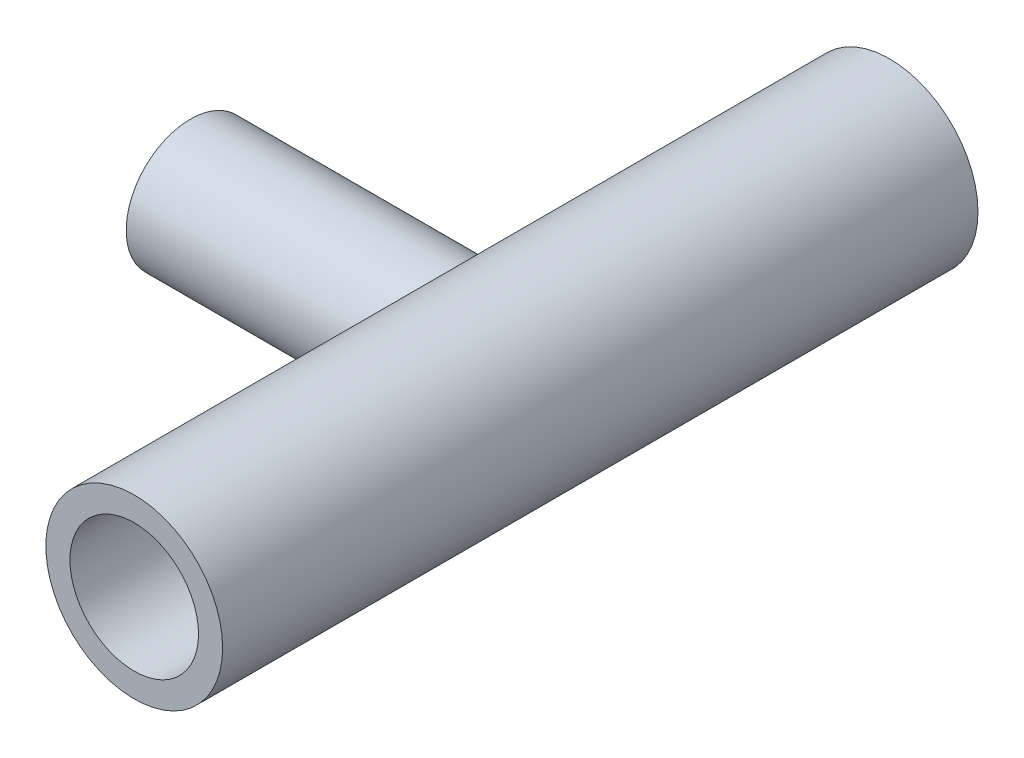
ISO-10303-21;
HEADER;
FILE_DESCRIPTION(('STEP AP214'),'2;1');
FILE_NAME('part.step','',(''),(''),'','','');
FILE_SCHEMA(('AUTOMOTIVE_DESIGN { 1 0 10303 214 1 1 1 1 }'));
ENDSEC;
DATA;
#1=APPLICATION_CONTEXT('core data for automotive mechanical design processes');
#2=APPLICATION_PROTOCOL_DEFINITION('international standard','automotive_design',2000,#1);
#3=PRODUCT_CONTEXT('',#1,'mechanical');
#4=PRODUCT('Part','Part','',(#3));
#5=PRODUCT_RELATED_PRODUCT_CATEGORY('part','',(#4));
#6=PRODUCT_DEFINITION_FORMATION('','',#4);
#7=PRODUCT_DEFINITION_CONTEXT('part definition',#1,'design');
#8=PRODUCT_DEFINITION('design','',#6,#7);
#9=PRODUCT_DEFINITION_SHAPE('','',#8);
#10=(LENGTH_UNIT() NAMED_UNIT(*) SI_UNIT(.MILLI.,.METRE.));
#11=(NAMED_UNIT(*) PLANE_ANGLE_UNIT() SI_UNIT($,.RADIAN.));
#12=(NAMED_UNIT(*) SI_UNIT($,.STERADIAN.) SOLID_ANGLE_UNIT());
#13=UNCERTAINTY_MEASURE_WITH_UNIT(LENGTH_MEASURE(1.E-05),#10,'distance_accuracy_value','');
#14=(GEOMETRIC_REPRESENTATION_CONTEXT(3) GLOBAL_UNCERTAINTY_ASSIGNED_CONTEXT((#13)) GLOBAL_UNIT_ASSIGNED_CONTEXT((#10,
#11,#12)) REPRESENTATION_CONTEXT('',''));
#15=CARTESIAN_POINT('',(0.,0.,0.));
#16=DIRECTION('',(0.,0.,1.));
#17=DIRECTION('',(1.,0.,0.));
#18=AXIS2_PLACEMENT_3D('',#15,#16,#17);
#19=CARTESIAN_POINT('',(0.,0.,0.));
#20=DIRECTION('',(1.,0.,0.));
#21=DIRECTION('',(0.,0.,-1.));
#22=AXIS2_PLACEMENT_3D('',#19,#20,#21);
#23=CYLINDRICAL_SURFACE('',#22,20.32);
#24=CARTESIAN_POINT('',(73.66,0.,-20.32));
#25=CARTESIAN_POINT('',(73.6600047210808,0.499914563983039,-20.319995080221));
#26=CARTESIAN_POINT('',(73.6734506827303,0.999977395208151,-20.3015175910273));
#27=CARTESIAN_POINT('',(73.7269310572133,1.99618720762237,-20.2278865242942));
#28=CARTESIAN_POINT('',(73.766982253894,2.49233151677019,-20.1727097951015));
#29=CARTESIAN_POINT('',(73.8728399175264,3.47768027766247,-20.0264016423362));
#30=CARTESIAN_POINT('',(73.9387055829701,3.96686608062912,-19.9351875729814));
#31=CARTESIAN_POINT('',(74.094650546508,4.93345998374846,-19.718233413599));
#32=CARTESIAN_POINT('',(74.1847263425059,5.41086977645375,-19.5924983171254));
#33=CARTESIAN_POINT('',(74.3865226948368,6.34812576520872,-19.3091164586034));
#34=CARTESIAN_POINT('',(74.4981103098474,6.80806006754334,-19.1516654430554));
#35=CARTESIAN_POINT('',(74.7410408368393,7.71093407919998,-18.8063167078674));
#36=CARTESIAN_POINT('',(74.8723844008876,8.15387322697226,-18.6184179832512));
#37=CARTESIAN_POINT('',(75.1523210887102,9.02059776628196,-18.2142732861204));
#38=CARTESIAN_POINT('',(75.3009047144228,9.44439352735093,-17.9980429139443));
#39=CARTESIAN_POINT('',(75.6128653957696,10.2717055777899,-17.5390508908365));
#40=CARTESIAN_POINT('',(75.7762443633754,10.675219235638,-17.2962858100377));
#41=CARTESIAN_POINT('',(76.1306034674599,11.4965747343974,-16.7628240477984));
#42=CARTESIAN_POINT('',(76.3227427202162,11.9123887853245,-16.4697765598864));
#43=CARTESIAN_POINT('',(76.7181410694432,12.7176226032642,-15.8562522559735));
#44=CARTESIAN_POINT('',(76.9214007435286,13.1070409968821,-15.5357740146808));
#45=CARTESIAN_POINT('',(77.3358866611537,13.8593322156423,-14.8685729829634));
#46=CARTESIAN_POINT('',(77.5471241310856,14.222165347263,-14.521812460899));
#47=CARTESIAN_POINT('',(77.9737020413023,14.9200854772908,-13.8037734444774));
#48=CARTESIAN_POINT('',(78.1890427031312,15.2551709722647,-13.4324936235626));
#49=CARTESIAN_POINT('',(78.6612610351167,15.958375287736,-12.5931333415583));
#50=CARTESIAN_POINT('',(78.9182135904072,16.3205725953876,-12.1201117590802));
#51=CARTESIAN_POINT('',(79.4256484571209,17.0036121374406,-11.1416231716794));
#52=CARTESIAN_POINT('',(79.6761289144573,17.3244426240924,-10.6361470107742));
#53=CARTESIAN_POINT('',(80.1623367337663,17.9225677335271,-9.59397562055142));
#54=CARTESIAN_POINT('',(80.3980808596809,18.1999123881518,-9.05731725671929));
#55=CARTESIAN_POINT('',(80.7336963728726,18.5814355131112,-8.22951338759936));
#56=CARTESIAN_POINT('',(80.8425495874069,18.70284160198,-7.94983000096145));
#57=CARTESIAN_POINT('',(81.0530214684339,18.9338233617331,-7.38284916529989));
#58=CARTESIAN_POINT('',(81.1546384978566,19.043396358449,-7.0955500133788));
#59=CARTESIAN_POINT('',(81.3823743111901,19.2854206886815,-6.41453609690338));
#60=CARTESIAN_POINT('',(81.5050540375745,19.4129577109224,-6.01789715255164));
#61=CARTESIAN_POINT('',(81.7313537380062,19.6445088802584,-5.2125927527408));
#62=CARTESIAN_POINT('',(81.8349796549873,19.7485303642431,-4.80393109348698));
#63=CARTESIAN_POINT('',(82.0195565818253,19.9315513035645,-3.9767704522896));
#64=CARTESIAN_POINT('',(82.1005489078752,20.0105963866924,-3.55829092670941));
#65=CARTESIAN_POINT('',(82.2369405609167,20.1426061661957,-2.7130665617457));
#66=CARTESIAN_POINT('',(82.292339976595,20.1955709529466,-2.28632175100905));
#67=CARTESIAN_POINT('',(82.3754118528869,20.2746681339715,-1.42438679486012));
#68=CARTESIAN_POINT('',(82.4028743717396,20.3005973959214,-0.989157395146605));
#69=CARTESIAN_POINT('',(82.4280162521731,20.3243437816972,-0.117076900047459));
#70=CARTESIAN_POINT('',(82.4256967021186,20.3221619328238,0.319774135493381));
#71=CARTESIAN_POINT('',(82.3913797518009,20.2897277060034,1.19152333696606));
#72=CARTESIAN_POINT('',(82.3593635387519,20.2594575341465,1.6264200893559));
#73=CARTESIAN_POINT('',(82.2671609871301,20.1714884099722,2.49040029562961));
#74=CARTESIAN_POINT('',(82.206971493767,20.1137863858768,2.91948309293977));
#75=CARTESIAN_POINT('',(82.0526547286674,19.9639109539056,3.81774418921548));
#76=CARTESIAN_POINT('',(81.9554178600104,19.8685335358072,4.2858507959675));
#77=CARTESIAN_POINT('',(81.7338296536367,19.6469677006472,5.2080821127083));
#78=CARTESIAN_POINT('',(81.6094743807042,19.5207748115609,5.66220478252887));
#79=CARTESIAN_POINT('',(81.3383865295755,19.2392522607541,6.55540145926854));
#80=CARTESIAN_POINT('',(81.1916115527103,19.0838672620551,6.9944449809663));
#81=CARTESIAN_POINT('',(80.8807092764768,18.7458618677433,7.85551104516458));
#82=CARTESIAN_POINT('',(80.7165803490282,18.5632389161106,8.27753198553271));
#83=CARTESIAN_POINT('',(80.3179655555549,18.1063184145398,9.24322425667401));
#84=CARTESIAN_POINT('',(80.0783984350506,17.8218583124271,9.78000745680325));
#85=CARTESIAN_POINT('',(79.5855529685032,17.2093687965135,10.8215149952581));
#86=CARTESIAN_POINT('',(79.3322703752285,16.8813258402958,11.3262292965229));
#87=CARTESIAN_POINT('',(78.8197986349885,16.1831311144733,12.3032287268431));
#88=CARTESIAN_POINT('',(78.560604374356,15.8129416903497,12.7754842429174));
#89=CARTESIAN_POINT('',(78.0436142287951,15.0319534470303,13.6858468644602));
#90=CARTESIAN_POINT('',(77.7858181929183,14.6211591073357,14.1239577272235));
#91=CARTESIAN_POINT('',(77.2747887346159,13.7544162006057,14.969622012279));
#92=CARTESIAN_POINT('',(77.0216545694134,13.2979612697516,15.3767176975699));
#93=CARTESIAN_POINT('',(76.5296708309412,12.3454298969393,16.1514615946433));
#94=CARTESIAN_POINT('',(76.2908227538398,11.849349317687,16.5191056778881));
#95=CARTESIAN_POINT('',(75.8339932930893,10.8200129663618,17.2108456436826));
#96=CARTESIAN_POINT('',(75.6159722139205,10.2868314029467,17.5350248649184));
#97=CARTESIAN_POINT('',(75.3088578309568,9.46075321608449,17.9859667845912));
#98=CARTESIAN_POINT('',(75.2098141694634,9.18103666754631,18.1303811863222));
#99=CARTESIAN_POINT('',(75.0190263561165,8.61308213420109,18.4069823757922));
#100=CARTESIAN_POINT('',(74.9272840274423,8.32484204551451,18.5391661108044));
#101=CARTESIAN_POINT('',(74.7091412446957,7.59809282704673,18.8519248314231));
#102=CARTESIAN_POINT('',(74.5876073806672,7.15473247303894,19.0247360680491));
#103=CARTESIAN_POINT('',(74.364634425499,6.25254655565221,19.3400194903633));
#104=CARTESIAN_POINT('',(74.2631909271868,5.79372440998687,19.4824983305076));
#105=CARTESIAN_POINT('',(74.0824306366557,4.86327172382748,19.7353296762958));
#106=CARTESIAN_POINT('',(74.0031022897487,4.39164801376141,19.8456989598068));
#107=CARTESIAN_POINT('',(73.8682006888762,3.4384021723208,20.0328656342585));
#108=CARTESIAN_POINT('',(73.8126280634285,2.95677977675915,20.1096621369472));
#109=CARTESIAN_POINT('',(73.7263362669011,1.98523511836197,20.2287326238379));
#110=CARTESIAN_POINT('',(73.6957098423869,1.49528873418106,20.2708777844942));
#111=CARTESIAN_POINT('',(73.6603789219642,0.512689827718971,20.3194858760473));
#112=CARTESIAN_POINT('',(73.6556743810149,0.0200373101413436,20.3259488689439));
#113=CARTESIAN_POINT('',(73.6722994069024,-0.964011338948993,20.3030864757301));
#114=CARTESIAN_POINT('',(73.6936301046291,-1.45540741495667,20.2737595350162));
#115=CARTESIAN_POINT('',(73.761821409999,-2.43300024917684,20.1797926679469));
#116=CARTESIAN_POINT('',(73.8086813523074,-2.91919714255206,20.1151536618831));
#117=CARTESIAN_POINT('',(73.9235052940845,-3.85552230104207,19.9562018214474));
#118=CARTESIAN_POINT('',(73.9901289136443,-4.30613751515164,19.8637696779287));
#119=CARTESIAN_POINT('',(74.143822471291,-5.19674046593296,19.6495813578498));
#120=CARTESIAN_POINT('',(74.2308914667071,-5.63672869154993,19.5278265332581));
#121=CARTESIAN_POINT('',(74.423877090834,-6.50378723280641,19.2564160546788));
#122=CARTESIAN_POINT('',(74.5297955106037,-6.93085631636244,19.1067577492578));
#123=CARTESIAN_POINT('',(74.7586507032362,-7.770122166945,18.7811140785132));
#124=CARTESIAN_POINT('',(74.8815884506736,-8.18231808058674,18.6051272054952));
#125=CARTESIAN_POINT('',(75.1534058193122,-9.02401268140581,18.2127103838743));
#126=CARTESIAN_POINT('',(75.3035940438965,-9.45208592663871,17.9941312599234));
#127=CARTESIAN_POINT('',(75.6190316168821,-10.287481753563,17.5299319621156));
#128=CARTESIAN_POINT('',(75.7842816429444,-10.6948034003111,17.2843105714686));
#129=CARTESIAN_POINT('',(76.1272581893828,-11.4878081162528,16.7677282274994));
#130=CARTESIAN_POINT('',(76.3049906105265,-11.8734807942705,16.4967552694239));
#131=CARTESIAN_POINT('',(76.6701736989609,-12.6222388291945,15.9311543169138));
#132=CARTESIAN_POINT('',(76.857625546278,-12.985321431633,15.6365234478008));
#133=CARTESIAN_POINT('',(77.2744203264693,-13.7525843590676,14.9690521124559));
#134=CARTESIAN_POINT('',(77.5051568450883,-14.1521437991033,14.5917605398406));
#135=CARTESIAN_POINT('',(77.9717261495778,-14.9180901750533,13.8077305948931));
#136=CARTESIAN_POINT('',(78.2075597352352,-15.2844718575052,13.4009875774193));
#137=CARTESIAN_POINT('',(78.6795219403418,-15.9835308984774,12.5590124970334));
#138=CARTESIAN_POINT('',(78.9156506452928,-16.3161812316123,12.1237580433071));
#139=CARTESIAN_POINT('',(79.3825459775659,-16.9464472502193,11.2259131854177));
#140=CARTESIAN_POINT('',(79.6133133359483,-17.2440677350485,10.7633265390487));
#141=CARTESIAN_POINT('',(80.0362555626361,-17.769304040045,9.8686344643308));
#142=CARTESIAN_POINT('',(80.2297328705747,-18.0010341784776,9.43955937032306));
#143=CARTESIAN_POINT('',(80.6030213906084,-18.4350864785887,8.56096038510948));
#144=CARTESIAN_POINT('',(80.782832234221,-18.6374078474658,8.11143594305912));
#145=CARTESIAN_POINT('',(81.1230835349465,-19.0106068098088,7.19335393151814));
#146=CARTESIAN_POINT('',(81.2835564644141,-19.1815373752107,6.72483008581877));
#147=CARTESIAN_POINT('',(81.5795095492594,-19.4902373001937,5.76930628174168));
#148=CARTESIAN_POINT('',(81.7149970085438,-19.6280163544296,5.28231177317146));
#149=CARTESIAN_POINT('',(81.9289860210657,-19.8421907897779,4.398822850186));
#150=CARTESIAN_POINT('',(82.0134761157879,-19.9254156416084,4.00542895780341));
#151=CARTESIAN_POINT('',(82.1604679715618,-20.0688509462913,3.21040364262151));
#152=CARTESIAN_POINT('',(82.2229726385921,-20.1290644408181,2.80877331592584));
#153=CARTESIAN_POINT('',(82.323568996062,-20.2254217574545,2.000077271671));
#154=CARTESIAN_POINT('',(82.3616904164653,-20.2615948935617,1.59301879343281));
#155=CARTESIAN_POINT('',(82.4120647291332,-20.3093073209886,0.775840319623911));
#156=CARTESIAN_POINT('',(82.4243174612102,-20.3208464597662,0.365720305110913));
#157=CARTESIAN_POINT('',(82.4224196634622,-20.3190554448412,-0.455015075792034));
#158=CARTESIAN_POINT('',(82.4082297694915,-20.3056882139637,-0.865630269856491));
#159=CARTESIAN_POINT('',(82.3539867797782,-20.2542822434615,-1.6835649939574));
#160=CARTESIAN_POINT('',(82.3139337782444,-20.2162435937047,-2.09088453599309));
#161=CARTESIAN_POINT('',(82.2095465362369,-20.1161407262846,-2.89994459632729));
#162=CARTESIAN_POINT('',(82.1451793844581,-20.0540439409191,-3.30167678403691));
#163=CARTESIAN_POINT('',(81.9945959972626,-19.9068526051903,-4.09672488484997));
#164=CARTESIAN_POINT('',(81.9083767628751,-19.8217548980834,-4.4900396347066));
#165=CARTESIAN_POINT('',(81.6877552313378,-19.6004436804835,-5.38491294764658));
#166=CARTESIAN_POINT('',(81.546676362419,-19.4565558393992,-5.88293622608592));
#167=CARTESIAN_POINT('',(81.238812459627,-19.1341384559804,-6.85943066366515));
#168=CARTESIAN_POINT('',(81.0720187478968,-18.9555972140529,-7.33789515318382));
#169=CARTESIAN_POINT('',(80.7188819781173,-18.565875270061,-8.27455830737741));
#170=CARTESIAN_POINT('',(80.5325142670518,-18.3546532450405,-8.73273035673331));
#171=CARTESIAN_POINT('',(80.1461544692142,-17.9015295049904,-9.62752052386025));
#172=CARTESIAN_POINT('',(79.9461633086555,-17.6596298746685,-10.0641401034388));
#173=CARTESIAN_POINT('',(79.531599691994,-17.1389402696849,-10.9279852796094));
#174=CARTESIAN_POINT('',(79.3167716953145,-16.8592770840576,-11.3545608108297));
#175=CARTESIAN_POINT('',(78.8828626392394,-16.2698866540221,-12.1840905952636));
#176=CARTESIAN_POINT('',(78.6637815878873,-15.9601594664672,-12.5870448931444));
#177=CARTESIAN_POINT('',(78.2256181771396,-15.3112764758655,-13.368819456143));
#178=CARTESIAN_POINT('',(78.0065358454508,-14.9721101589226,-13.7476310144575));
#179=CARTESIAN_POINT('',(77.5724248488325,-14.2650411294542,-14.4799899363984));
#180=CARTESIAN_POINT('',(77.3573966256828,-13.8971353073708,-14.8335345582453));
#181=CARTESIAN_POINT('',(76.8891915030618,-13.0499768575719,-15.5880882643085));
#182=CARTESIAN_POINT('',(76.6378992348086,-12.5639191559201,-15.982677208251));
#183=CARTESIAN_POINT('',(76.1534801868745,-11.5513326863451,-16.7291590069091));
#184=CARTESIAN_POINT('',(75.9203575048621,-11.0247948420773,-17.0810422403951));
#185=CARTESIAN_POINT('',(75.4790086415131,-9.93394397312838,-17.7376433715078));
#186=CARTESIAN_POINT('',(75.270757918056,-9.36966905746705,-18.0424078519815));
#187=CARTESIAN_POINT('',(74.8852849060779,-8.20625218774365,-18.600416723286));
#188=CARTESIAN_POINT('',(74.7080464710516,-7.60712859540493,-18.853687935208));
#189=CARTESIAN_POINT('',(74.4356897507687,-6.55363076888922,-19.239841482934));
#190=CARTESIAN_POINT('',(74.3315543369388,-6.10657201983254,-19.3864741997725));
#191=CARTESIAN_POINT('',(74.1441111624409,-5.1992500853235,-19.6492528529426));
#192=CARTESIAN_POINT('',(74.0608027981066,-4.73898728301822,-19.7653996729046));
#193=CARTESIAN_POINT('',(73.9169109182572,-3.80931657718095,-19.9653957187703));
#194=CARTESIAN_POINT('',(73.8562675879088,-3.33993623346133,-20.0493299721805));
#195=CARTESIAN_POINT('',(73.7587139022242,-2.39418248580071,-20.1841073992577));
#196=CARTESIAN_POINT('',(73.7217906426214,-1.91781302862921,-20.2349685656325));
#197=CARTESIAN_POINT('',(73.6847673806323,-1.20038726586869,-20.2859341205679));
#198=CARTESIAN_POINT('',(73.6754865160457,-0.960614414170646,-20.2987016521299));
#199=CARTESIAN_POINT('',(73.6631012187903,-0.480572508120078,-20.3157364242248));
#200=CARTESIAN_POINT('',(73.6599977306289,-0.24030338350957,-20.3200023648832));
#201=CARTESIAN_POINT('',(73.66,0.,-20.32));
#202=B_SPLINE_CURVE_WITH_KNOTS('',3,(#24,#25,#26,#27,#28,#29,#30,#31,#32,#33,#34,#35,#36,#37,
#38,#39,#40,#41,#42,#43,#44,#45,#46,#47,#48,#49,#50,#51,#52,#53,#54,#55,#56,#57,#58,#59,#60,#61,
#62,#63,#64,#65,#66,#67,#68,#69,#70,#71,#72,#73,#74,#75,#76,#77,#78,#79,#80,#81,#82,#83,#84,#85,
#86,#87,#88,#89,#90,#91,#92,#93,#94,#95,#96,#97,#98,#99,#100,#101,#102,#103,#104,#105,#106,#107,
#108,#109,#110,#111,#112,#113,#114,#115,#116,#117,#118,#119,#120,#121,#122,#123,#124,#125,#126,
#127,#128,#129,#130,#131,#132,#133,#134,#135,#136,#137,#138,#139,#140,#141,#142,#143,#144,#145,
#146,#147,#148,#149,#150,#151,#152,#153,#154,#155,#156,#157,#158,#159,#160,#161,#162,#163,#164,
#165,#166,#167,#168,#169,#170,#171,#172,#173,#174,#175,#176,#177,#178,#179,#180,#181,#182,#183,
#184,#185,#186,#187,#188,#189,#190,#191,#192,#193,#194,#195,#196,#197,#198,#199,#200,#201),
.UNSPECIFIED.,.T.,.F.,(4,2,2,2,2,2,2,2,2,2,2,2,2,2,2,2,2,2,2,2,2,2,2,2,2,2,2,2,2,2,2,2,2,2,2,2,
2,2,2,2,2,2,2,2,2,2,2,2,2,2,2,2,2,2,2,2,2,2,2,2,2,2,2,2,2,2,2,2,2,2,2,2,2,2,2,2,2,2,2,2,2,2,2,2,
2,2,2,2,4),(0.,1.49948350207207,2.99991384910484,4.50380535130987,6.00747942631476,
7.50214270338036,8.99685532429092,10.4907483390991,11.984834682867,13.6146338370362,
15.2445177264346,16.8767875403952,18.5091457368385,20.4533981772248,22.3982015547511,
24.3407506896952,25.311665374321,26.2827990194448,27.5846123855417,28.8860190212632,
30.1850342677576,31.4840450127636,32.7927470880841,34.1014013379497,35.4108851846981,
36.7205157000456,38.1809335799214,39.6415635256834,41.104990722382,42.5685553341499,
44.5249437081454,46.4819414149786,48.4407014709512,50.3992456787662,52.3826161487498,
54.3661939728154,56.3459124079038,57.3355881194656,58.3255101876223,59.7972827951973,
61.2687321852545,62.7394113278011,64.2101293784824,65.6862907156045,67.1624494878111,
68.638672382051,70.1148568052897,71.5077256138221,72.9005302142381,74.293467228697,
75.6864840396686,77.1957174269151,78.7050187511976,80.2150384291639,81.725241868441,
83.5115243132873,85.2980891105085,87.0860741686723,88.8738139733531,90.4464305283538,
92.0190894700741,93.5890696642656,95.1585901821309,96.3900480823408,97.6213431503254,
98.8511340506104,100.080932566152,101.312563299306,102.544189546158,103.777488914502,
105.01095763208,106.620273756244,108.230134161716,109.842047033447,111.453850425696,
113.112879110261,114.771904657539,116.431525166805,118.091325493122,120.112425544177,
122.133980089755,124.15352311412,126.172011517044,127.616204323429,129.06035526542,
130.500667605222,131.940195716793,132.660870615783,133.381655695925),.UNSPECIFIED.);
#203=CARTESIAN_POINT('',(73.66,0.,-20.32));
#204=VERTEX_POINT('',#203);
#205=EDGE_CURVE('E10',#204,#204,#202,.T.);
#206=ORIENTED_EDGE('',*,*,#205,.F.);
#207=EDGE_LOOP('',(#206));
#208=FACE_BOUND('',#207,.T.);
#209=CARTESIAN_POINT('',(0.,0.,0.));
#210=DIRECTION('',(1.,0.,0.));
#211=DIRECTION('',(0.,0.,-1.));
#212=AXIS2_PLACEMENT_3D('',#209,#210,#211);
#213=CIRCLE('',#212,20.32);
#214=CARTESIAN_POINT('',(0.,0.,-20.32));
#215=VERTEX_POINT('',#214);
#216=EDGE_CURVE('E50',#215,#215,#213,.T.);
#217=ORIENTED_EDGE('',*,*,#216,.T.);
#218=EDGE_LOOP('',(#217));
#219=FACE_BOUND('',#218,.T.);
#220=ADVANCED_FACE('F37',(#208,#219),#23,.T.);
#221=CARTESIAN_POINT('',(0.,0.,0.));
#222=DIRECTION('',(1.,0.,0.));
#223=DIRECTION('',(0.,0.,-1.));
#224=AXIS2_PLACEMENT_3D('',#221,#222,#223);
#225=PLANE('',#224);
#226=ORIENTED_EDGE('',*,*,#216,.F.);
#227=EDGE_LOOP('',(#226));
#228=FACE_BOUND('',#227,.T.);
#229=ADVANCED_FACE('F90',(#228),#225,.F.);
#230=CARTESIAN_POINT('',(101.6,0.,-198.406253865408));
#231=DIRECTION('',(0.,0.,1.));
#232=DIRECTION('',(1.,0.,0.));
#233=AXIS2_PLACEMENT_3D('',#230,#231,#232);
#234=CYLINDRICAL_SURFACE('',#233,27.94);
#235=ORIENTED_EDGE('',*,*,#205,.T.);
#236=EDGE_LOOP('',(#235));
#237=FACE_BOUND('',#236,.T.);
#238=CARTESIAN_POINT('',(101.6,0.,-119.38));
#239=DIRECTION('',(0.,0.,1.));
#240=DIRECTION('',(1.,0.,0.));
#241=AXIS2_PLACEMENT_3D('',#238,#239,#240);
#242=CIRCLE('',#241,27.94);
#243=CARTESIAN_POINT('',(129.54,0.,-119.38));
#244=VERTEX_POINT('',#243);
#245=EDGE_CURVE('E55',#244,#244,#242,.F.);
#246=ORIENTED_EDGE('',*,*,#245,.F.);
#247=EDGE_LOOP('',(#246));
#248=FACE_BOUND('',#247,.T.);
#249=CARTESIAN_POINT('',(101.6,0.,119.38));
#250=DIRECTION('',(0.,0.,1.));
#251=DIRECTION('',(1.,0.,0.));
#252=AXIS2_PLACEMENT_3D('',#249,#250,#251);
#253=CIRCLE('',#252,27.94);
#254=CARTESIAN_POINT('',(129.54,0.,119.38));
#255=VERTEX_POINT('',#254);
#256=EDGE_CURVE('E60',#255,#255,#253,.T.);
#257=ORIENTED_EDGE('',*,*,#256,.F.);
#258=EDGE_LOOP('',(#257));
#259=FACE_BOUND('',#258,.T.);
#260=ADVANCED_FACE('F88',(#237,#248,#259),#234,.T.);
#261=CARTESIAN_POINT('',(101.6,0.,-119.38));
#262=DIRECTION('',(0.,0.,1.));
#263=DIRECTION('',(1.,0.,0.));
#264=AXIS2_PLACEMENT_3D('',#261,#262,#263);
#265=PLANE('',#264);
#266=CARTESIAN_POINT('',(101.6,0.,-119.38));
#267=DIRECTION('',(0.,0.,1.));
#268=DIRECTION('',(1.,0.,0.));
#269=AXIS2_PLACEMENT_3D('',#266,#267,#268);
#270=CIRCLE('',#269,20.32);
#271=CARTESIAN_POINT('',(121.92,0.,-119.38));
#272=VERTEX_POINT('',#271);
#273=EDGE_CURVE('E66',#272,#272,#270,.T.);
#274=ORIENTED_EDGE('',*,*,#273,.T.);
#275=EDGE_LOOP('',(#274));
#276=FACE_BOUND('',#275,.T.);
#277=ORIENTED_EDGE('',*,*,#245,.T.);
#278=EDGE_LOOP('',(#277));
#279=FACE_BOUND('',#278,.T.);
#280=ADVANCED_FACE('F75',(#276,#279),#265,.F.);
#281=CARTESIAN_POINT('',(101.6,0.,119.38));
#282=DIRECTION('',(0.,0.,1.));
#283=DIRECTION('',(1.,0.,0.));
#284=AXIS2_PLACEMENT_3D('',#281,#282,#283);
#285=PLANE('',#284);
#286=CARTESIAN_POINT('',(101.6,0.,119.38));
#287=DIRECTION('',(0.,0.,1.));
#288=DIRECTION('',(1.,0.,0.));
#289=AXIS2_PLACEMENT_3D('',#286,#287,#288);
#290=CIRCLE('',#289,20.32);
#291=CARTESIAN_POINT('',(121.92,0.,119.38));
#292=VERTEX_POINT('',#291);
#293=EDGE_CURVE('E67',#292,#292,#290,.T.);
#294=ORIENTED_EDGE('',*,*,#293,.F.);
#295=EDGE_LOOP('',(#294));
#296=FACE_BOUND('',#295,.T.);
#297=ORIENTED_EDGE('',*,*,#256,.T.);
#298=EDGE_LOOP('',(#297));
#299=FACE_BOUND('',#298,.T.);
#300=ADVANCED_FACE('F39',(#296,#299),#285,.T.);
#301=CARTESIAN_POINT('',(101.6,0.,-119.38));
#302=DIRECTION('',(0.,0.,1.));
#303=DIRECTION('',(1.,0.,0.));
#304=AXIS2_PLACEMENT_3D('',#301,#302,#303);
#305=CYLINDRICAL_SURFACE('',#304,20.32);
#306=ORIENTED_EDGE('',*,*,#273,.F.);
#307=EDGE_LOOP('',(#306));
#308=FACE_BOUND('',#307,.T.);
#309=ORIENTED_EDGE('',*,*,#293,.T.);
#310=EDGE_LOOP('',(#309));
#311=FACE_BOUND('',#310,.T.);
#312=ADVANCED_FACE('F78',(#308,#311),#305,.F.);
#313=CLOSED_SHELL('',(#220,#229,#260,#280,#300,#312));
#314=MANIFOLD_SOLID_BREP('B2',#313);
#315=ADVANCED_BREP_SHAPE_REPRESENTATION('',(#18,#314),#14);
#316=SHAPE_DEFINITION_REPRESENTATION(#9,#315);
ENDSEC;
END-ISO-10303-21;
